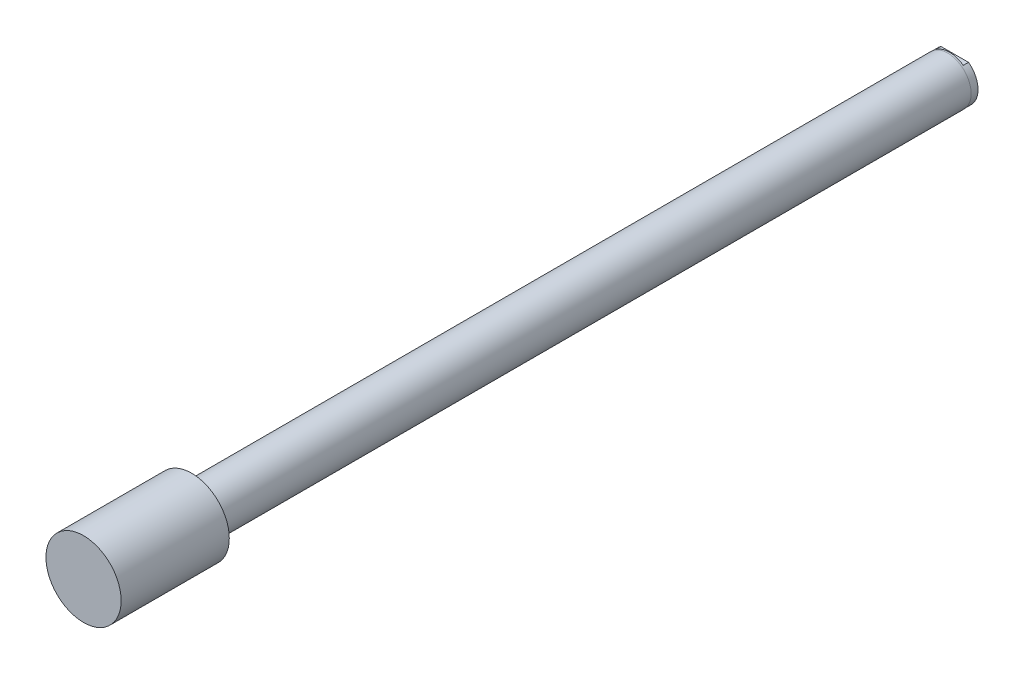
ISO-10303-21;
HEADER;
FILE_DESCRIPTION(('STEP AP214'),'2;1');
FILE_NAME('part.step','',(''),(''),'','','');
FILE_SCHEMA(('AUTOMOTIVE_DESIGN { 1 0 10303 214 1 1 1 1 }'));
ENDSEC;
DATA;
#1=APPLICATION_CONTEXT('core data for automotive mechanical design processes');
#2=APPLICATION_PROTOCOL_DEFINITION('international standard','automotive_design',2000,#1);
#3=PRODUCT_CONTEXT('',#1,'mechanical');
#4=PRODUCT('Part','Part','',(#3));
#5=PRODUCT_RELATED_PRODUCT_CATEGORY('part','',(#4));
#6=PRODUCT_DEFINITION_FORMATION('','',#4);
#7=PRODUCT_DEFINITION_CONTEXT('part definition',#1,'design');
#8=PRODUCT_DEFINITION('design','',#6,#7);
#9=PRODUCT_DEFINITION_SHAPE('','',#8);
#10=(LENGTH_UNIT() NAMED_UNIT(*) SI_UNIT(.MILLI.,.METRE.));
#11=(NAMED_UNIT(*) PLANE_ANGLE_UNIT() SI_UNIT($,.RADIAN.));
#12=(NAMED_UNIT(*) SI_UNIT($,.STERADIAN.) SOLID_ANGLE_UNIT());
#13=UNCERTAINTY_MEASURE_WITH_UNIT(LENGTH_MEASURE(1.E-05),#10,'distance_accuracy_value','');
#14=(GEOMETRIC_REPRESENTATION_CONTEXT(3) GLOBAL_UNCERTAINTY_ASSIGNED_CONTEXT((#13)) GLOBAL_UNIT_ASSIGNED_CONTEXT((#10,
#11,#12)) REPRESENTATION_CONTEXT('',''));
#15=CARTESIAN_POINT('',(0.,0.,0.));
#16=DIRECTION('',(0.,0.,1.));
#17=DIRECTION('',(1.,0.,0.));
#18=AXIS2_PLACEMENT_3D('',#15,#16,#17);
#19=CARTESIAN_POINT('',(0.,0.,39.5986));
#20=DIRECTION('',(0.,0.,-1.));
#21=DIRECTION('',(-1.,0.,0.));
#22=AXIS2_PLACEMENT_3D('',#19,#20,#21);
#23=CYLINDRICAL_SURFACE('',#22,7.25);
#24=CARTESIAN_POINT('',(0.,0.,33.528));
#25=DIRECTION('',(0.,0.,-1.));
#26=DIRECTION('',(0.,1.,0.));
#27=AXIS2_PLACEMENT_3D('',#24,#25,#26);
#28=CIRCLE('',#27,7.25);
#29=CARTESIAN_POINT('',(0.,7.25,33.528));
#30=VERTEX_POINT('',#29);
#31=EDGE_CURVE('E25',#30,#30,#28,.T.);
#32=ORIENTED_EDGE('',*,*,#31,.F.);
#33=EDGE_LOOP('',(#32));
#34=FACE_BOUND('',#33,.T.);
#35=CARTESIAN_POINT('',(0.,0.,0.));
#36=DIRECTION('',(0.,0.,-1.));
#37=DIRECTION('',(1.,0.,0.));
#38=AXIS2_PLACEMENT_3D('',#35,#36,#37);
#39=CIRCLE('',#38,7.25);
#40=CARTESIAN_POINT('',(7.25,0.,0.));
#41=VERTEX_POINT('',#40);
#42=EDGE_CURVE('E77',#41,#41,#39,.T.);
#43=ORIENTED_EDGE('',*,*,#42,.T.);
#44=EDGE_LOOP('',(#43));
#45=FACE_BOUND('',#44,.T.);
#46=ADVANCED_FACE('F16',(#34,#45),#23,.F.);
#47=CARTESIAN_POINT('',(0.,0.,588.27760000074));
#48=DIRECTION('',(0.,0.,1.));
#49=DIRECTION('',(1.,0.,0.));
#50=AXIS2_PLACEMENT_3D('',#47,#48,#49);
#51=PLANE('',#50);
#52=CARTESIAN_POINT('',(0.,0.,588.27760000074));
#53=DIRECTION('',(0.,0.,1.));
#54=DIRECTION('',(1.,0.,0.));
#55=AXIS2_PLACEMENT_3D('',#52,#53,#54);
#56=CIRCLE('',#55,25.4);
#57=CARTESIAN_POINT('',(25.4,0.,588.27760000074));
#58=VERTEX_POINT('',#57);
#59=EDGE_CURVE('E109',#58,#58,#56,.T.);
#60=ORIENTED_EDGE('',*,*,#59,.T.);
#61=EDGE_LOOP('',(#60));
#62=FACE_BOUND('',#61,.T.);
#63=ADVANCED_FACE('F134',(#62),#51,.T.);
#64=CARTESIAN_POINT('',(0.,0.,588.27760000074));
#65=DIRECTION('',(0.,0.,-1.));
#66=DIRECTION('',(-1.,0.,0.));
#67=AXIS2_PLACEMENT_3D('',#64,#65,#66);
#68=CYLINDRICAL_SURFACE('',#67,25.4);
#69=ORIENTED_EDGE('',*,*,#59,.F.);
#70=EDGE_LOOP('',(#69));
#71=FACE_BOUND('',#70,.T.);
#72=CARTESIAN_POINT('',(0.,0.,515.25260000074));
#73=DIRECTION('',(0.,0.,1.));
#74=DIRECTION('',(1.,0.,0.));
#75=AXIS2_PLACEMENT_3D('',#72,#73,#74);
#76=CIRCLE('',#75,25.4);
#77=CARTESIAN_POINT('',(25.4,0.,515.25260000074));
#78=VERTEX_POINT('',#77);
#79=EDGE_CURVE('E106',#78,#78,#76,.T.);
#80=ORIENTED_EDGE('',*,*,#79,.T.);
#81=EDGE_LOOP('',(#80));
#82=FACE_BOUND('',#81,.T.);
#83=ADVANCED_FACE('F123',(#71,#82),#68,.T.);
#84=CARTESIAN_POINT('',(0.,0.,515.25260000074));
#85=DIRECTION('',(0.,0.,1.));
#86=DIRECTION('',(1.,0.,0.));
#87=AXIS2_PLACEMENT_3D('',#84,#85,#86);
#88=PLANE('',#87);
#89=CARTESIAN_POINT('',(0.,0.,515.25260000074));
#90=DIRECTION('',(0.,0.,1.));
#91=DIRECTION('',(1.,0.,0.));
#92=AXIS2_PLACEMENT_3D('',#89,#90,#91);
#93=CIRCLE('',#92,15.875);
#94=CARTESIAN_POINT('',(15.875,0.,515.25260000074));
#95=VERTEX_POINT('',#94);
#96=EDGE_CURVE('E73',#95,#95,#93,.F.);
#97=ORIENTED_EDGE('',*,*,#96,.F.);
#98=EDGE_LOOP('',(#97));
#99=FACE_BOUND('',#98,.T.);
#100=ORIENTED_EDGE('',*,*,#79,.F.);
#101=EDGE_LOOP('',(#100));
#102=FACE_BOUND('',#101,.T.);
#103=ADVANCED_FACE('F120',(#99,#102),#88,.F.);
#104=CARTESIAN_POINT('',(0.,0.,515.25260000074));
#105=DIRECTION('',(0.,0.,-1.));
#106=DIRECTION('',(-1.,0.,0.));
#107=AXIS2_PLACEMENT_3D('',#104,#105,#106);
#108=CYLINDRICAL_SURFACE('',#107,15.875);
#109=CARTESIAN_POINT('',(0.,0.,4.7752));
#110=DIRECTION('',(0.,0.,-1.));
#111=DIRECTION('',(-1.,0.,0.));
#112=AXIS2_PLACEMENT_3D('',#109,#110,#111);
#113=CIRCLE('',#112,15.875);
#114=CARTESIAN_POINT('',(-15.875,0.,4.7752));
#115=VERTEX_POINT('',#114);
#116=EDGE_CURVE('E70',#115,#115,#113,.T.);
#117=ORIENTED_EDGE('',*,*,#116,.F.);
#118=EDGE_LOOP('',(#117));
#119=FACE_BOUND('',#118,.T.);
#120=ORIENTED_EDGE('',*,*,#96,.T.);
#121=EDGE_LOOP('',(#120));
#122=FACE_BOUND('',#121,.T.);
#123=ADVANCED_FACE('F118',(#119,#122),#108,.T.);
#124=CARTESIAN_POINT('',(0.,0.,4.7752));
#125=DIRECTION('',(0.,0.,-1.));
#126=DIRECTION('',(-1.,0.,0.));
#127=AXIS2_PLACEMENT_3D('',#124,#125,#126);
#128=PLANE('',#127);
#129=CARTESIAN_POINT('',(0.,0.,4.7752));
#130=DIRECTION('',(0.,0.,-1.));
#131=DIRECTION('',(0.,1.,0.));
#132=AXIS2_PLACEMENT_3D('',#129,#130,#131);
#133=CIRCLE('',#132,15.7607);
#134=CARTESIAN_POINT('',(0.,15.7607,4.7752));
#135=VERTEX_POINT('',#134);
#136=EDGE_CURVE('E10',#135,#135,#133,.T.);
#137=ORIENTED_EDGE('',*,*,#136,.F.);
#138=EDGE_LOOP('',(#137));
#139=FACE_BOUND('',#138,.T.);
#140=ORIENTED_EDGE('',*,*,#116,.T.);
#141=EDGE_LOOP('',(#140));
#142=FACE_BOUND('',#141,.T.);
#143=ADVANCED_FACE('F131',(#139,#142),#128,.T.);
#144=CARTESIAN_POINT('',(0.,0.,3.556));
#145=DIRECTION('',(0.,0.,-1.));
#146=DIRECTION('',(1.,0.,0.));
#147=AXIS2_PLACEMENT_3D('',#144,#145,#146);
#148=PLANE('',#147);
#149=CARTESIAN_POINT('',(0.,0.,3.556));
#150=DIRECTION('',(0.,0.,-1.));
#151=DIRECTION('',(1.,0.,0.));
#152=AXIS2_PLACEMENT_3D('',#149,#150,#151);
#153=CIRCLE('',#152,15.7607);
#154=CARTESIAN_POINT('',(-9.33325583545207,12.7,3.556));
#155=VERTEX_POINT('',#154);
#156=CARTESIAN_POINT('',(9.33325583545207,12.7,3.556));
#157=VERTEX_POINT('',#156);
#158=EDGE_CURVE('E81',#155,#157,#153,.T.);
#159=ORIENTED_EDGE('',*,*,#158,.T.);
#160=DIRECTION('',(-1.,0.,0.));
#161=VECTOR('',#160,1.);
#162=CARTESIAN_POINT('',(-9.33325583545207,12.7,3.556));
#163=LINE('',#162,#161);
#164=EDGE_CURVE('E83',#157,#155,#163,.T.);
#165=ORIENTED_EDGE('',*,*,#164,.T.);
#166=EDGE_LOOP('',(#159,#165));
#167=FACE_BOUND('',#166,.T.);
#168=ADVANCED_FACE('F141',(#167),#148,.T.);
#169=CARTESIAN_POINT('',(0.,0.,3.556));
#170=DIRECTION('',(0.,0.,-1.));
#171=DIRECTION('',(1.,0.,0.));
#172=AXIS2_PLACEMENT_3D('',#169,#170,#171);
#173=PLANE('',#172);
#174=CARTESIAN_POINT('',(0.,0.,3.556));
#175=DIRECTION('',(0.,0.,-1.));
#176=DIRECTION('',(1.,0.,0.));
#177=AXIS2_PLACEMENT_3D('',#174,#175,#176);
#178=CIRCLE('',#177,15.7607);
#179=CARTESIAN_POINT('',(9.33325583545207,-12.7,3.556));
#180=VERTEX_POINT('',#179);
#181=CARTESIAN_POINT('',(-9.33325583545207,-12.7,3.556));
#182=VERTEX_POINT('',#181);
#183=EDGE_CURVE('E92',#180,#182,#178,.T.);
#184=ORIENTED_EDGE('',*,*,#183,.T.);
#185=DIRECTION('',(1.,0.,0.));
#186=VECTOR('',#185,1.);
#187=CARTESIAN_POINT('',(-9.33325583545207,-12.7,3.556));
#188=LINE('',#187,#186);
#189=EDGE_CURVE('E94',#182,#180,#188,.T.);
#190=ORIENTED_EDGE('',*,*,#189,.T.);
#191=EDGE_LOOP('',(#184,#190));
#192=FACE_BOUND('',#191,.T.);
#193=ADVANCED_FACE('F146',(#192),#173,.T.);
#194=CARTESIAN_POINT('',(-9.33325583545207,-12.7,3.556));
#195=DIRECTION('',(0.,1.,0.));
#196=DIRECTION('',(0.,0.,1.));
#197=AXIS2_PLACEMENT_3D('',#194,#195,#196);
#198=PLANE('',#197);
#199=DIRECTION('',(1.,0.,0.));
#200=VECTOR('',#199,1.);
#201=CARTESIAN_POINT('',(-9.33325583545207,-12.7,0.));
#202=LINE('',#201,#200);
#203=CARTESIAN_POINT('',(-9.33325583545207,-12.7,0.));
#204=VERTEX_POINT('',#203);
#205=CARTESIAN_POINT('',(9.33325583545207,-12.7,0.));
#206=VERTEX_POINT('',#205);
#207=EDGE_CURVE('E90',#204,#206,#202,.T.);
#208=ORIENTED_EDGE('',*,*,#207,.T.);
#209=DIRECTION('',(0.,0.,-1.));
#210=VECTOR('',#209,1.);
#211=CARTESIAN_POINT('',(9.33325583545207,-12.7,3.556));
#212=LINE('',#211,#210);
#213=EDGE_CURVE('E98',#180,#206,#212,.T.);
#214=ORIENTED_EDGE('',*,*,#213,.F.);
#215=ORIENTED_EDGE('',*,*,#189,.F.);
#216=DIRECTION('',(0.,0.,-1.));
#217=VECTOR('',#216,1.);
#218=CARTESIAN_POINT('',(-9.33325583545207,-12.7,3.556));
#219=LINE('',#218,#217);
#220=EDGE_CURVE('E41',#182,#204,#219,.T.);
#221=ORIENTED_EDGE('',*,*,#220,.T.);
#222=EDGE_LOOP('',(#208,#214,#215,#221));
#223=FACE_BOUND('',#222,.T.);
#224=ADVANCED_FACE('F154',(#223),#198,.F.);
#225=CARTESIAN_POINT('',(0.,0.,0.));
#226=DIRECTION('',(0.,0.,-1.));
#227=DIRECTION('',(1.,0.,0.));
#228=AXIS2_PLACEMENT_3D('',#225,#226,#227);
#229=PLANE('',#228);
#230=ORIENTED_EDGE('',*,*,#42,.F.);
#231=EDGE_LOOP('',(#230));
#232=FACE_BOUND('',#231,.T.);
#233=DIRECTION('',(-1.,0.,0.));
#234=VECTOR('',#233,1.);
#235=CARTESIAN_POINT('',(-9.33325583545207,12.7,0.));
#236=LINE('',#235,#234);
#237=CARTESIAN_POINT('',(9.33325583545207,12.7,0.));
#238=VERTEX_POINT('',#237);
#239=CARTESIAN_POINT('',(-9.33325583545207,12.7,0.));
#240=VERTEX_POINT('',#239);
#241=EDGE_CURVE('E80',#238,#240,#236,.T.);
#242=ORIENTED_EDGE('',*,*,#241,.F.);
#243=CARTESIAN_POINT('',(0.,0.,0.));
#244=DIRECTION('',(0.,0.,-1.));
#245=DIRECTION('',(1.,0.,0.));
#246=AXIS2_PLACEMENT_3D('',#243,#244,#245);
#247=CIRCLE('',#246,15.7607);
#248=EDGE_CURVE('E100',#238,#206,#247,.T.);
#249=ORIENTED_EDGE('',*,*,#248,.T.);
#250=ORIENTED_EDGE('',*,*,#207,.F.);
#251=EDGE_CURVE('E20',#204,#240,#247,.T.);
#252=ORIENTED_EDGE('',*,*,#251,.T.);
#253=EDGE_LOOP('',(#242,#249,#250,#252));
#254=FACE_BOUND('',#253,.T.);
#255=ADVANCED_FACE('F151',(#232,#254),#229,.T.);
#256=CARTESIAN_POINT('',(-9.33325583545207,12.7,3.556));
#257=DIRECTION('',(0.,-1.,0.));
#258=DIRECTION('',(0.,0.,-1.));
#259=AXIS2_PLACEMENT_3D('',#256,#257,#258);
#260=PLANE('',#259);
#261=ORIENTED_EDGE('',*,*,#241,.T.);
#262=DIRECTION('',(0.,0.,-1.));
#263=VECTOR('',#262,1.);
#264=CARTESIAN_POINT('',(-9.33325583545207,12.7,3.556));
#265=LINE('',#264,#263);
#266=EDGE_CURVE('E87',#155,#240,#265,.T.);
#267=ORIENTED_EDGE('',*,*,#266,.F.);
#268=ORIENTED_EDGE('',*,*,#164,.F.);
#269=DIRECTION('',(0.,0.,-1.));
#270=VECTOR('',#269,1.);
#271=CARTESIAN_POINT('',(9.33325583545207,12.7,3.556));
#272=LINE('',#271,#270);
#273=EDGE_CURVE('E33',#157,#238,#272,.T.);
#274=ORIENTED_EDGE('',*,*,#273,.T.);
#275=EDGE_LOOP('',(#261,#267,#268,#274));
#276=FACE_BOUND('',#275,.T.);
#277=ADVANCED_FACE('F148',(#276),#260,.F.);
#278=CARTESIAN_POINT('',(0.,0.,4.7752));
#279=DIRECTION('',(0.,0.,-1.));
#280=DIRECTION('',(1.,0.,0.));
#281=AXIS2_PLACEMENT_3D('',#278,#279,#280);
#282=CYLINDRICAL_SURFACE('',#281,15.7607);
#283=ORIENTED_EDGE('',*,*,#266,.T.);
#284=ORIENTED_EDGE('',*,*,#251,.F.);
#285=ORIENTED_EDGE('',*,*,#220,.F.);
#286=ORIENTED_EDGE('',*,*,#183,.F.);
#287=ORIENTED_EDGE('',*,*,#213,.T.);
#288=ORIENTED_EDGE('',*,*,#248,.F.);
#289=ORIENTED_EDGE('',*,*,#273,.F.);
#290=ORIENTED_EDGE('',*,*,#158,.F.);
#291=EDGE_LOOP('',(#283,#284,#285,#286,#287,#288,#289,#290));
#292=FACE_BOUND('',#291,.T.);
#293=ORIENTED_EDGE('',*,*,#136,.T.);
#294=EDGE_LOOP('',(#293));
#295=FACE_BOUND('',#294,.T.);
#296=ADVANCED_FACE('F18',(#292,#295),#282,.T.);
#297=CARTESIAN_POINT('',(0.,0.,33.528));
#298=DIRECTION('',(0.,0.,-1.));
#299=DIRECTION('',(1.,0.,0.));
#300=AXIS2_PLACEMENT_3D('',#297,#298,#299);
#301=CONICAL_SURFACE('',#300,7.25,1.02974425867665);
#302=CARTESIAN_POINT('',(0.,0.,37.8842394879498));
#303=VERTEX_POINT('',#302);
#304=VERTEX_LOOP('',#303);
#305=FACE_BOUND('',#304,.T.);
#306=ORIENTED_EDGE('',*,*,#31,.T.);
#307=EDGE_LOOP('',(#306));
#308=FACE_BOUND('',#307,.T.);
#309=ADVANCED_FACE('F63',(#305,#308),#301,.F.);
#310=CLOSED_SHELL('',(#46,#63,#83,#103,#123,#143,#168,#193,#224,#255,#277,#296,#309));
#311=MANIFOLD_SOLID_BREP('B1',#310);
#312=ADVANCED_BREP_SHAPE_REPRESENTATION('',(#18,#311),#14);
#313=SHAPE_DEFINITION_REPRESENTATION(#9,#312);
ENDSEC;
END-ISO-10303-21;
